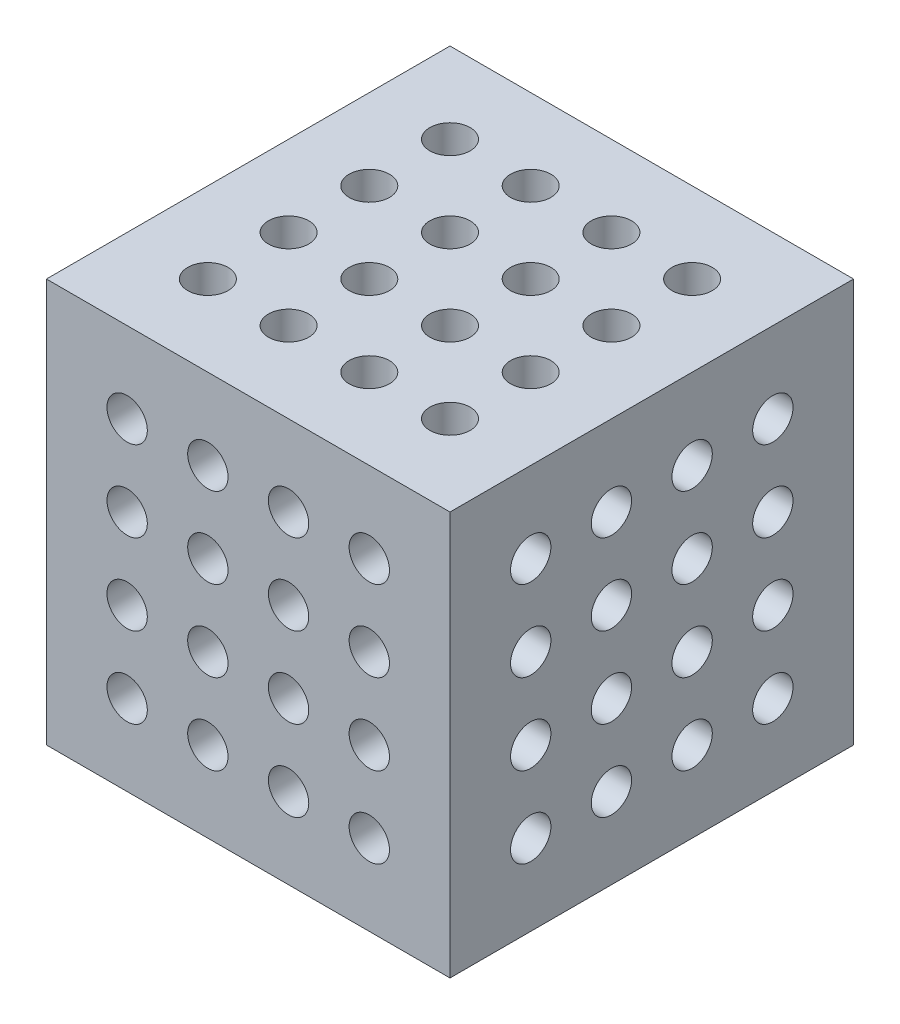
from build123d import *

# Parameters (mm, degrees)
SKIZZE1_W                   = 50
SKIZZE1_H                   = 50
LINEAR_AUSTRAGEN1_DEPTH     = 50
SKIZZE2_R                   = 2.5
LINEAR_AUSTRAGEN2_DEPTH     = 5
LINEARES_MUSTER1_COUNT      = 4
LINEARES_MUSTER1_PITCH      = 10
LINEARES_MUSTER1_COUNT_DIR2 = 4
LINEARES_MUSTER1_PITCH_DIR2 = 10
SKIZZE3_R                   = 2.5
LINEAR_AUSTRAGEN3_DEPTH     = 5
LINEARES_MUSTER2_COUNT      = 4
LINEARES_MUSTER2_PITCH      = 10
LINEARES_MUSTER2_COUNT_DIR2 = 4
LINEARES_MUSTER2_PITCH_DIR2 = 10
SKIZZE4_R                   = 2.5
LINEAR_AUSTRAGEN4_DEPTH     = 5
LINEARES_MUSTER3_COUNT      = 4
LINEARES_MUSTER3_PITCH      = 10
LINEARES_MUSTER3_COUNT_DIR2 = 4
LINEARES_MUSTER3_PITCH_DIR2 = 10


with BuildPart() as part:
    # Skizze1 → Linear austragen1 (new body)
    with BuildSketch(Plane.XY):
        with Locations((25, 25)):
            Rectangle(SKIZZE1_W, SKIZZE1_H)
    extrude(amount=LINEAR_AUSTRAGEN1_DEPTH)

    # Skizze2 → Linear austragen2 (cut)
    with BuildSketch(Plane.XY.offset(50)):
        with Locations((10, 40)):
            Circle(SKIZZE2_R)
    linear_austragen2 = extrude(amount=-LINEAR_AUSTRAGEN2_DEPTH, mode=Mode.SUBTRACT)

    # Lineares Muster1: Linear austragen2 4 × 4
    with Locations(*[(i * LINEARES_MUSTER1_PITCH, -j * LINEARES_MUSTER1_PITCH_DIR2, 0) for i in range(LINEARES_MUSTER1_COUNT) for j in range(LINEARES_MUSTER1_COUNT_DIR2) if (i, j) != (0, 0)]):
        add(linear_austragen2, mode=Mode.SUBTRACT)

    # Skizze3 → Linear austragen3 (cut)
    with BuildSketch(Plane(origin=(50, 0, 0), x_dir=(0, 0, -1), z_dir=(1, 0, 0))):
        with Locations((-40, 40)):
            Circle(SKIZZE3_R)
    linear_austragen3 = extrude(amount=-LINEAR_AUSTRAGEN3_DEPTH, mode=Mode.SUBTRACT)

    # Lineares Muster2: Linear austragen3 4 × 4
    with Locations(*[(0, -j * LINEARES_MUSTER2_PITCH_DIR2, -i * LINEARES_MUSTER2_PITCH) for i in range(LINEARES_MUSTER2_COUNT) for j in range(LINEARES_MUSTER2_COUNT_DIR2) if (i, j) != (0, 0)]):
        add(linear_austragen3, mode=Mode.SUBTRACT)

    # Skizze4 → Linear austragen4 (cut)
    with BuildSketch(Plane(origin=(0, 50, 0), x_dir=(-1, 0, 0), z_dir=(0, 1, 0))):
        with Locations(Location((-10, 40, 0), (0, 0, 90))):
            Circle(SKIZZE4_R)
    linear_austragen4 = extrude(amount=-LINEAR_AUSTRAGEN4_DEPTH, mode=Mode.SUBTRACT)

    # Lineares Muster3: Linear austragen4 4 × 4
    with Locations(*[(j * LINEARES_MUSTER3_PITCH_DIR2, 0, -i * LINEARES_MUSTER3_PITCH) for i in range(LINEARES_MUSTER3_COUNT) for j in range(LINEARES_MUSTER3_COUNT_DIR2) if (i, j) != (0, 0)]):
        add(linear_austragen4, mode=Mode.SUBTRACT)


solid = part.part
